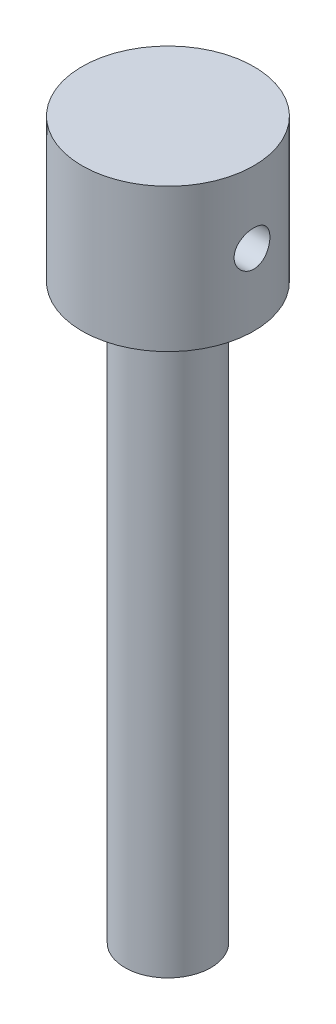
ISO-10303-21;
HEADER;
FILE_DESCRIPTION(('STEP AP214'),'2;1');
FILE_NAME('part.step','',(''),(''),'','','');
FILE_SCHEMA(('AUTOMOTIVE_DESIGN { 1 0 10303 214 1 1 1 1 }'));
ENDSEC;
DATA;
#1=APPLICATION_CONTEXT('core data for automotive mechanical design processes');
#2=APPLICATION_PROTOCOL_DEFINITION('international standard','automotive_design',2000,#1);
#3=PRODUCT_CONTEXT('',#1,'mechanical');
#4=PRODUCT('Part','Part','',(#3));
#5=PRODUCT_RELATED_PRODUCT_CATEGORY('part','',(#4));
#6=PRODUCT_DEFINITION_FORMATION('','',#4);
#7=PRODUCT_DEFINITION_CONTEXT('part definition',#1,'design');
#8=PRODUCT_DEFINITION('design','',#6,#7);
#9=PRODUCT_DEFINITION_SHAPE('','',#8);
#10=(LENGTH_UNIT() NAMED_UNIT(*) SI_UNIT(.MILLI.,.METRE.));
#11=(NAMED_UNIT(*) PLANE_ANGLE_UNIT() SI_UNIT($,.RADIAN.));
#12=(NAMED_UNIT(*) SI_UNIT($,.STERADIAN.) SOLID_ANGLE_UNIT());
#13=UNCERTAINTY_MEASURE_WITH_UNIT(LENGTH_MEASURE(1.E-05),#10,'distance_accuracy_value','');
#14=(GEOMETRIC_REPRESENTATION_CONTEXT(3) GLOBAL_UNCERTAINTY_ASSIGNED_CONTEXT((#13)) GLOBAL_UNIT_ASSIGNED_CONTEXT((#10,
#11,#12)) REPRESENTATION_CONTEXT('',''));
#15=CARTESIAN_POINT('',(0.,0.,0.));
#16=DIRECTION('',(0.,0.,1.));
#17=DIRECTION('',(1.,0.,0.));
#18=AXIS2_PLACEMENT_3D('',#15,#16,#17);
#19=CARTESIAN_POINT('',(0.,-20.,0.));
#20=DIRECTION('',(0.,1.,0.));
#21=DIRECTION('',(0.,0.,1.));
#22=AXIS2_PLACEMENT_3D('',#19,#20,#21);
#23=CYLINDRICAL_SURFACE('',#22,12.);
#24=CARTESIAN_POINT('',(-11.7366945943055,-10.,-2.5));
#25=CARTESIAN_POINT('',(-11.7366973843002,-10.1387812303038,-2.499995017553));
#26=CARTESIAN_POINT('',(-11.7391829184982,-10.2776239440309,-2.48840458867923));
#27=CARTESIAN_POINT('',(-11.7488403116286,-10.551372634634,-2.44239298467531));
#28=CARTESIAN_POINT('',(-11.7560157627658,-10.6862755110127,-2.40795430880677));
#29=CARTESIAN_POINT('',(-11.7742058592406,-10.9481447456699,-2.31736795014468));
#30=CARTESIAN_POINT('',(-11.7852165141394,-11.0751191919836,-2.26124282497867));
#31=CARTESIAN_POINT('',(-11.8098316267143,-11.3178489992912,-2.12893977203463));
#32=CARTESIAN_POINT('',(-11.8234359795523,-11.43360481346,-2.05276265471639));
#33=CARTESIAN_POINT('',(-11.8519386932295,-11.6523907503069,-1.88127279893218));
#34=CARTESIAN_POINT('',(-11.8668522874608,-11.7552237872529,-1.78571110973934));
#35=CARTESIAN_POINT('',(-11.8961593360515,-11.9435221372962,-1.57870244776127));
#36=CARTESIAN_POINT('',(-11.9105527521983,-12.0289861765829,-1.46725431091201));
#37=CARTESIAN_POINT('',(-11.937362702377,-12.1808917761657,-1.23032410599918));
#38=CARTESIAN_POINT('',(-11.9497591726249,-12.2471450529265,-1.10471885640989));
#39=CARTESIAN_POINT('',(-11.971006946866,-12.3575321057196,-0.843857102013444));
#40=CARTESIAN_POINT('',(-11.9798586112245,-12.4016681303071,-0.708601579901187));
#41=CARTESIAN_POINT('',(-11.9929117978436,-12.4659515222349,-0.434325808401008));
#42=CARTESIAN_POINT('',(-11.9971778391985,-12.4864320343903,-0.295386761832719));
#43=CARTESIAN_POINT('',(-12.0008022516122,-12.503863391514,-0.0159836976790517));
#44=CARTESIAN_POINT('',(-12.0001611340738,-12.5008166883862,0.124480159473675));
#45=CARTESIAN_POINT('',(-11.9940931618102,-12.4715307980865,0.400653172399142));
#46=CARTESIAN_POINT('',(-11.9887403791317,-12.4456505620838,0.536402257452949));
#47=CARTESIAN_POINT('',(-11.9739344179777,-12.3720027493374,0.801587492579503));
#48=CARTESIAN_POINT('',(-11.9644810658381,-12.3242342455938,0.931023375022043));
#49=CARTESIAN_POINT('',(-11.9424153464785,-12.207839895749,1.18092001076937));
#50=CARTESIAN_POINT('',(-11.9297820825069,-12.1390754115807,1.3013142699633));
#51=CARTESIAN_POINT('',(-11.9027460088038,-11.9827439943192,1.5289869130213));
#52=CARTESIAN_POINT('',(-11.8883429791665,-11.8951747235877,1.63626366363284));
#53=CARTESIAN_POINT('',(-11.8590340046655,-11.7017567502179,1.83678840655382));
#54=CARTESIAN_POINT('',(-11.8441236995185,-11.5955938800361,1.92973297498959));
#55=CARTESIAN_POINT('',(-11.8157374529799,-11.3690359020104,2.09655194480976));
#56=CARTESIAN_POINT('',(-11.8022615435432,-11.2486404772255,2.1704259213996));
#57=CARTESIAN_POINT('',(-11.7782599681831,-10.9965754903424,2.29712434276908));
#58=CARTESIAN_POINT('',(-11.7677417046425,-10.8648786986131,2.34989610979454));
#59=CARTESIAN_POINT('',(-11.7509521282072,-10.5942167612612,2.43247155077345));
#60=CARTESIAN_POINT('',(-11.7446802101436,-10.4552526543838,2.46227849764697));
#61=CARTESIAN_POINT('',(-11.7372156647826,-10.1767605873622,2.49761727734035));
#62=CARTESIAN_POINT('',(-11.7359310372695,-10.0372908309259,2.50358885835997));
#63=CARTESIAN_POINT('',(-11.7383390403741,-9.75934837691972,2.49227386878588));
#64=CARTESIAN_POINT('',(-11.7420313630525,-9.62087561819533,2.47498873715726));
#65=CARTESIAN_POINT('',(-11.7538907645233,-9.35035896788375,2.41803116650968));
#66=CARTESIAN_POINT('',(-11.76201022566,-9.21826266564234,2.37859682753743));
#67=CARTESIAN_POINT('',(-11.7817667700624,-8.96255202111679,2.27871621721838));
#68=CARTESIAN_POINT('',(-11.7934041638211,-8.8389384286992,2.21826809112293));
#69=CARTESIAN_POINT('',(-11.8190900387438,-8.60178711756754,2.07709196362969));
#70=CARTESIAN_POINT('',(-11.8331701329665,-8.48841559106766,1.99609065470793));
#71=CARTESIAN_POINT('',(-11.8620696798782,-8.27671350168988,1.81646888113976));
#72=CARTESIAN_POINT('',(-11.8768892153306,-8.17838462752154,1.71784644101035));
#73=CARTESIAN_POINT('',(-11.9058984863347,-7.99787457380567,1.50380090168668));
#74=CARTESIAN_POINT('',(-11.9200734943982,-7.91599180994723,1.38812381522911));
#75=CARTESIAN_POINT('',(-11.9459341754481,-7.77282249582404,1.14440020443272));
#76=CARTESIAN_POINT('',(-11.9576199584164,-7.7115350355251,1.01635422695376));
#77=CARTESIAN_POINT('',(-11.9771229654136,-7.61172264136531,0.752284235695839));
#78=CARTESIAN_POINT('',(-11.9849632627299,-7.57306166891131,0.616313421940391));
#79=CARTESIAN_POINT('',(-11.9959912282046,-7.51917119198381,0.339626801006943));
#80=CARTESIAN_POINT('',(-11.9991795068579,-7.50393861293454,0.198911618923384));
#81=CARTESIAN_POINT('',(-12.0005281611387,-7.49746475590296,-0.0804266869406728));
#82=CARTESIAN_POINT('',(-11.9987822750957,-7.5057762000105,-0.219039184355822));
#83=CARTESIAN_POINT('',(-11.99065748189,-7.5451612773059,-0.492845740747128));
#84=CARTESIAN_POINT('',(-11.9842786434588,-7.57623457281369,-0.628039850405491));
#85=CARTESIAN_POINT('',(-11.9676092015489,-7.66005558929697,-0.890863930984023));
#86=CARTESIAN_POINT('',(-11.9573290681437,-7.71274532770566,-1.01851310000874));
#87=CARTESIAN_POINT('',(-11.9339599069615,-7.83824479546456,-1.2632211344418));
#88=CARTESIAN_POINT('',(-11.9208706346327,-7.91105627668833,-1.38027907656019));
#89=CARTESIAN_POINT('',(-11.8930319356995,-8.07621933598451,-1.60268064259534));
#90=CARTESIAN_POINT('',(-11.8782576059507,-8.1688885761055,-1.70778526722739));
#91=CARTESIAN_POINT('',(-11.8488557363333,-8.37048900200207,-1.90110548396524));
#92=CARTESIAN_POINT('',(-11.8342282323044,-8.47942405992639,-1.98931704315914));
#93=CARTESIAN_POINT('',(-11.8065838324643,-8.71201820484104,-2.14734903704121));
#94=CARTESIAN_POINT('',(-11.7935881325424,-8.83583682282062,-2.21693856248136));
#95=CARTESIAN_POINT('',(-11.7709407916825,-9.09365031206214,-2.3342125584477));
#96=CARTESIAN_POINT('',(-11.7612862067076,-9.22763609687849,-2.381916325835));
#97=CARTESIAN_POINT('',(-11.7482800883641,-9.4682125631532,-2.44513108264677));
#98=CARTESIAN_POINT('',(-11.7439632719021,-9.57345907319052,-2.46566898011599));
#99=CARTESIAN_POINT('',(-11.7381695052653,-9.78579156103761,-2.49310508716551));
#100=CARTESIAN_POINT('',(-11.7366924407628,-9.89287746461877,-2.50000384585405));
#101=CARTESIAN_POINT('',(-11.7366945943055,-10.,-2.5));
#102=B_SPLINE_CURVE_WITH_KNOTS('',3,(#24,#25,#26,#27,#28,#29,#30,#31,#32,#33,#34,#35,#36,#37,
#38,#39,#40,#41,#42,#43,#44,#45,#46,#47,#48,#49,#50,#51,#52,#53,#54,#55,#56,#57,#58,#59,#60,#61,
#62,#63,#64,#65,#66,#67,#68,#69,#70,#71,#72,#73,#74,#75,#76,#77,#78,#79,#80,#81,#82,#83,#84,#85,
#86,#87,#88,#89,#90,#91,#92,#93,#94,#95,#96,#97,#98,#99,#100,#101),.UNSPECIFIED.,.T.,.F.,(4,2,2,
2,2,2,2,2,2,2,2,2,2,2,2,2,2,2,2,2,2,2,2,2,2,2,2,2,2,2,2,2,2,2,2,2,2,2,4),(0.,0.415951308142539,
0.832221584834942,1.24806002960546,1.66388166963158,2.0854266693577,2.50700257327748,
2.93258052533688,3.35811520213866,3.77758097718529,4.19700303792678,4.60994682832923,
5.02290810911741,5.43865743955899,5.8544584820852,6.27811724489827,6.70178544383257,
7.12650474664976,7.55116350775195,7.96795032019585,8.38471134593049,8.79707572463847,
9.20947650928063,9.62767835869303,10.0459271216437,10.4711891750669,10.8964324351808,
11.3190919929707,11.7416960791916,12.1563258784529,12.5709495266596,12.984468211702,
13.3980229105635,13.8187663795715,14.2396101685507,14.6654530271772,15.0909196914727,
15.4119973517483,15.7330620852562),.UNSPECIFIED.);
#103=CARTESIAN_POINT('',(-11.7366945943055,-10.,-2.5));
#104=VERTEX_POINT('',#103);
#105=EDGE_CURVE('E41',#104,#104,#102,.T.);
#106=ORIENTED_EDGE('',*,*,#105,.F.);
#107=EDGE_LOOP('',(#106));
#108=FACE_BOUND('',#107,.T.);
#109=CARTESIAN_POINT('',(11.7366945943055,-10.,-2.5));
#110=CARTESIAN_POINT('',(11.7366973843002,-9.86121876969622,-2.499995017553));
#111=CARTESIAN_POINT('',(11.7391829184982,-9.7223760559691,-2.48840458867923));
#112=CARTESIAN_POINT('',(11.7488403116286,-9.44862736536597,-2.44239298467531));
#113=CARTESIAN_POINT('',(11.7560157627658,-9.31372448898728,-2.40795430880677));
#114=CARTESIAN_POINT('',(11.7742058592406,-9.05185525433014,-2.31736795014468));
#115=CARTESIAN_POINT('',(11.7852165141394,-8.92488080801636,-2.26124282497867));
#116=CARTESIAN_POINT('',(11.8098316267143,-8.68215100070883,-2.12893977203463));
#117=CARTESIAN_POINT('',(11.8234359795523,-8.56639518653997,-2.05276265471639));
#118=CARTESIAN_POINT('',(11.8519386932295,-8.34760924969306,-1.88127279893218));
#119=CARTESIAN_POINT('',(11.8668522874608,-8.24477621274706,-1.78571110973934));
#120=CARTESIAN_POINT('',(11.8961593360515,-8.05647786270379,-1.57870244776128));
#121=CARTESIAN_POINT('',(11.9105527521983,-7.97101382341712,-1.46725431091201));
#122=CARTESIAN_POINT('',(11.937362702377,-7.81910822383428,-1.23032410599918));
#123=CARTESIAN_POINT('',(11.9497591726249,-7.75285494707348,-1.10471885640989));
#124=CARTESIAN_POINT('',(11.971006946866,-7.64246789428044,-0.843857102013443));
#125=CARTESIAN_POINT('',(11.9798586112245,-7.59833186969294,-0.708601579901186));
#126=CARTESIAN_POINT('',(11.9929117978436,-7.53404847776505,-0.434325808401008));
#127=CARTESIAN_POINT('',(11.9971778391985,-7.51356796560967,-0.295386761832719));
#128=CARTESIAN_POINT('',(12.0008022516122,-7.49613660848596,-0.0159836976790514));
#129=CARTESIAN_POINT('',(12.0001611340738,-7.49918331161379,0.124480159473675));
#130=CARTESIAN_POINT('',(11.9940931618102,-7.52846920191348,0.400653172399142));
#131=CARTESIAN_POINT('',(11.9887403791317,-7.55434943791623,0.536402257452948));
#132=CARTESIAN_POINT('',(11.9739344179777,-7.62799725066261,0.801587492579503));
#133=CARTESIAN_POINT('',(11.9644810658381,-7.67576575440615,0.931023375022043));
#134=CARTESIAN_POINT('',(11.9424153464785,-7.79216010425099,1.18092001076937));
#135=CARTESIAN_POINT('',(11.9297820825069,-7.86092458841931,1.3013142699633));
#136=CARTESIAN_POINT('',(11.9027460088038,-8.01725600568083,1.5289869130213));
#137=CARTESIAN_POINT('',(11.8883429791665,-8.10482527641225,1.63626366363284));
#138=CARTESIAN_POINT('',(11.8590340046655,-8.29824324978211,1.83678840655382));
#139=CARTESIAN_POINT('',(11.8441236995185,-8.40440611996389,1.92973297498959));
#140=CARTESIAN_POINT('',(11.8157374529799,-8.6309640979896,2.09655194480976));
#141=CARTESIAN_POINT('',(11.8022615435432,-8.75135952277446,2.1704259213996));
#142=CARTESIAN_POINT('',(11.7782599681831,-9.00342450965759,2.29712434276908));
#143=CARTESIAN_POINT('',(11.7677417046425,-9.13512130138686,2.34989610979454));
#144=CARTESIAN_POINT('',(11.7509521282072,-9.40578323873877,2.43247155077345));
#145=CARTESIAN_POINT('',(11.7446802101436,-9.54474734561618,2.46227849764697));
#146=CARTESIAN_POINT('',(11.7372156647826,-9.82323941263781,2.49761727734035));
#147=CARTESIAN_POINT('',(11.7359310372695,-9.96270916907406,2.50358885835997));
#148=CARTESIAN_POINT('',(11.7383390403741,-10.2406516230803,2.49227386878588));
#149=CARTESIAN_POINT('',(11.7420313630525,-10.3791243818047,2.47498873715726));
#150=CARTESIAN_POINT('',(11.7538907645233,-10.6496410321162,2.41803116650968));
#151=CARTESIAN_POINT('',(11.7620102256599,-10.7817373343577,2.37859682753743));
#152=CARTESIAN_POINT('',(11.7817667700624,-11.0374479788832,2.27871621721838));
#153=CARTESIAN_POINT('',(11.7934041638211,-11.1610615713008,2.21826809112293));
#154=CARTESIAN_POINT('',(11.8190900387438,-11.3982128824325,2.07709196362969));
#155=CARTESIAN_POINT('',(11.8331701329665,-11.5115844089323,1.99609065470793));
#156=CARTESIAN_POINT('',(11.8620696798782,-11.7232864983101,1.81646888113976));
#157=CARTESIAN_POINT('',(11.8768892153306,-11.8216153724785,1.71784644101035));
#158=CARTESIAN_POINT('',(11.9058984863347,-12.0021254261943,1.50380090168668));
#159=CARTESIAN_POINT('',(11.9200734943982,-12.0840081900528,1.38812381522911));
#160=CARTESIAN_POINT('',(11.9459341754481,-12.227177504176,1.14440020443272));
#161=CARTESIAN_POINT('',(11.9576199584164,-12.2884649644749,1.01635422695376));
#162=CARTESIAN_POINT('',(11.9771229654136,-12.3882773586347,0.752284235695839));
#163=CARTESIAN_POINT('',(11.9849632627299,-12.4269383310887,0.616313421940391));
#164=CARTESIAN_POINT('',(11.9959912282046,-12.4808288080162,0.339626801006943));
#165=CARTESIAN_POINT('',(11.9991795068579,-12.4960613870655,0.198911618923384));
#166=CARTESIAN_POINT('',(12.0005281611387,-12.502535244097,-0.0804266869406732));
#167=CARTESIAN_POINT('',(11.9987822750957,-12.4942237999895,-0.219039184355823));
#168=CARTESIAN_POINT('',(11.99065748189,-12.4548387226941,-0.492845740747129));
#169=CARTESIAN_POINT('',(11.9842786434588,-12.4237654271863,-0.628039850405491));
#170=CARTESIAN_POINT('',(11.9676092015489,-12.339944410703,-0.890863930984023));
#171=CARTESIAN_POINT('',(11.9573290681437,-12.2872546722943,-1.01851310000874));
#172=CARTESIAN_POINT('',(11.9339599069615,-12.1617552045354,-1.2632211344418));
#173=CARTESIAN_POINT('',(11.9208706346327,-12.0889437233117,-1.38027907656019));
#174=CARTESIAN_POINT('',(11.8930319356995,-11.9237806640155,-1.60268064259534));
#175=CARTESIAN_POINT('',(11.8782576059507,-11.8311114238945,-1.70778526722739));
#176=CARTESIAN_POINT('',(11.8488557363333,-11.6295109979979,-1.90110548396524));
#177=CARTESIAN_POINT('',(11.8342282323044,-11.5205759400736,-1.98931704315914));
#178=CARTESIAN_POINT('',(11.8065838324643,-11.287981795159,-2.14734903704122));
#179=CARTESIAN_POINT('',(11.7935881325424,-11.1641631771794,-2.21693856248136));
#180=CARTESIAN_POINT('',(11.7709407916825,-10.9063496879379,-2.3342125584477));
#181=CARTESIAN_POINT('',(11.7612862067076,-10.7723639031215,-2.381916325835));
#182=CARTESIAN_POINT('',(11.7482800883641,-10.5317874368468,-2.44513108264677));
#183=CARTESIAN_POINT('',(11.7439632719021,-10.4265409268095,-2.46566898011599));
#184=CARTESIAN_POINT('',(11.7381695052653,-10.2142084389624,-2.49310508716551));
#185=CARTESIAN_POINT('',(11.7366924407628,-10.1071225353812,-2.50000384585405));
#186=CARTESIAN_POINT('',(11.7366945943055,-10.,-2.5));
#187=B_SPLINE_CURVE_WITH_KNOTS('',3,(#109,#110,#111,#112,#113,#114,#115,#116,#117,#118,#119,
#120,#121,#122,#123,#124,#125,#126,#127,#128,#129,#130,#131,#132,#133,#134,#135,#136,#137,#138,
#139,#140,#141,#142,#143,#144,#145,#146,#147,#148,#149,#150,#151,#152,#153,#154,#155,#156,#157,
#158,#159,#160,#161,#162,#163,#164,#165,#166,#167,#168,#169,#170,#171,#172,#173,#174,#175,#176,
#177,#178,#179,#180,#181,#182,#183,#184,#185,#186),.UNSPECIFIED.,.T.,.F.,(4,2,2,2,2,2,2,2,2,2,2,
2,2,2,2,2,2,2,2,2,2,2,2,2,2,2,2,2,2,2,2,2,2,2,2,2,2,2,4),(0.,0.415951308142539,
0.832221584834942,1.24806002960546,1.66388166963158,2.0854266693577,2.50700257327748,
2.93258052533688,3.35811520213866,3.77758097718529,4.19700303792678,4.60994682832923,
5.02290810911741,5.43865743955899,5.8544584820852,6.27811724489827,6.70178544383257,
7.12650474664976,7.55116350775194,7.96795032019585,8.38471134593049,8.79707572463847,
9.20947650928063,9.62767835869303,10.0459271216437,10.4711891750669,10.8964324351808,
11.3190919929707,11.7416960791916,12.1563258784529,12.5709495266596,12.984468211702,
13.3980229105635,13.8187663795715,14.2396101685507,14.6654530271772,15.0909196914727,
15.4119973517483,15.7330620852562),.UNSPECIFIED.);
#188=CARTESIAN_POINT('',(11.7366945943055,-10.,-2.5));
#189=VERTEX_POINT('',#188);
#190=EDGE_CURVE('E10',#189,#189,#187,.T.);
#191=ORIENTED_EDGE('',*,*,#190,.F.);
#192=EDGE_LOOP('',(#191));
#193=FACE_BOUND('',#192,.T.);
#194=CARTESIAN_POINT('',(0.,-20.,0.));
#195=DIRECTION('',(0.,1.,0.));
#196=DIRECTION('',(0.,0.,1.));
#197=AXIS2_PLACEMENT_3D('',#194,#195,#196);
#198=CIRCLE('',#197,12.);
#199=CARTESIAN_POINT('',(0.,-20.,12.));
#200=VERTEX_POINT('',#199);
#201=EDGE_CURVE('E55',#200,#200,#198,.T.);
#202=ORIENTED_EDGE('',*,*,#201,.T.);
#203=EDGE_LOOP('',(#202));
#204=FACE_BOUND('',#203,.T.);
#205=CARTESIAN_POINT('',(0.,0.,0.));
#206=DIRECTION('',(0.,1.,0.));
#207=DIRECTION('',(0.,0.,1.));
#208=AXIS2_PLACEMENT_3D('',#205,#206,#207);
#209=CIRCLE('',#208,12.);
#210=CARTESIAN_POINT('',(0.,0.,12.));
#211=VERTEX_POINT('',#210);
#212=EDGE_CURVE('E61',#211,#211,#209,.T.);
#213=ORIENTED_EDGE('',*,*,#212,.F.);
#214=EDGE_LOOP('',(#213));
#215=FACE_BOUND('',#214,.T.);
#216=ADVANCED_FACE('F37',(#108,#193,#204,#215),#23,.T.);
#217=CARTESIAN_POINT('',(0.,-20.,0.));
#218=DIRECTION('',(0.,1.,0.));
#219=DIRECTION('',(0.,0.,1.));
#220=AXIS2_PLACEMENT_3D('',#217,#218,#219);
#221=PLANE('',#220);
#222=CARTESIAN_POINT('',(0.,-20.,0.));
#223=DIRECTION('',(0.,-1.,0.));
#224=DIRECTION('',(0.,0.,-1.));
#225=AXIS2_PLACEMENT_3D('',#222,#223,#224);
#226=CIRCLE('',#225,6.);
#227=CARTESIAN_POINT('',(0.,-20.,-6.));
#228=VERTEX_POINT('',#227);
#229=EDGE_CURVE('E50',#228,#228,#226,.T.);
#230=ORIENTED_EDGE('',*,*,#229,.F.);
#231=EDGE_LOOP('',(#230));
#232=FACE_BOUND('',#231,.T.);
#233=ORIENTED_EDGE('',*,*,#201,.F.);
#234=EDGE_LOOP('',(#233));
#235=FACE_BOUND('',#234,.T.);
#236=ADVANCED_FACE('F78',(#232,#235),#221,.F.);
#237=CARTESIAN_POINT('',(0.,0.,0.));
#238=DIRECTION('',(0.,1.,0.));
#239=DIRECTION('',(0.,0.,1.));
#240=AXIS2_PLACEMENT_3D('',#237,#238,#239);
#241=PLANE('',#240);
#242=ORIENTED_EDGE('',*,*,#212,.T.);
#243=EDGE_LOOP('',(#242));
#244=FACE_BOUND('',#243,.T.);
#245=ADVANCED_FACE('F76',(#244),#241,.T.);
#246=CARTESIAN_POINT('',(0.,-100.,0.));
#247=DIRECTION('',(0.,1.,0.));
#248=DIRECTION('',(0.,0.,1.));
#249=AXIS2_PLACEMENT_3D('',#246,#247,#248);
#250=CYLINDRICAL_SURFACE('',#249,6.);
#251=CARTESIAN_POINT('',(0.,-100.,0.));
#252=DIRECTION('',(0.,-1.,0.));
#253=DIRECTION('',(0.,0.,-1.));
#254=AXIS2_PLACEMENT_3D('',#251,#252,#253);
#255=CIRCLE('',#254,6.);
#256=CARTESIAN_POINT('',(0.,-100.,-6.));
#257=VERTEX_POINT('',#256);
#258=EDGE_CURVE('E99',#257,#257,#255,.T.);
#259=ORIENTED_EDGE('',*,*,#258,.F.);
#260=EDGE_LOOP('',(#259));
#261=FACE_BOUND('',#260,.T.);
#262=ORIENTED_EDGE('',*,*,#229,.T.);
#263=EDGE_LOOP('',(#262));
#264=FACE_BOUND('',#263,.T.);
#265=ADVANCED_FACE('F72',(#261,#264),#250,.T.);
#266=CARTESIAN_POINT('',(0.,-100.,0.));
#267=DIRECTION('',(0.,-1.,0.));
#268=DIRECTION('',(0.,0.,-1.));
#269=AXIS2_PLACEMENT_3D('',#266,#267,#268);
#270=PLANE('',#269);
#271=ORIENTED_EDGE('',*,*,#258,.T.);
#272=EDGE_LOOP('',(#271));
#273=FACE_BOUND('',#272,.T.);
#274=ADVANCED_FACE('F67',(#273),#270,.T.);
#275=CARTESIAN_POINT('',(-68.,-10.,0.));
#276=DIRECTION('',(1.,0.,0.));
#277=DIRECTION('',(0.,0.,-1.));
#278=AXIS2_PLACEMENT_3D('',#275,#276,#277);
#279=CYLINDRICAL_SURFACE('',#278,2.5);
#280=ORIENTED_EDGE('',*,*,#105,.T.);
#281=EDGE_LOOP('',(#280));
#282=FACE_BOUND('',#281,.T.);
#283=ORIENTED_EDGE('',*,*,#190,.T.);
#284=EDGE_LOOP('',(#283));
#285=FACE_BOUND('',#284,.T.);
#286=ADVANCED_FACE('F63',(#282,#285),#279,.F.);
#287=CLOSED_SHELL('',(#216,#236,#245,#265,#274,#286));
#288=MANIFOLD_SOLID_BREP('B2',#287);
#289=ADVANCED_BREP_SHAPE_REPRESENTATION('',(#18,#288),#14);
#290=SHAPE_DEFINITION_REPRESENTATION(#9,#289);
ENDSEC;
END-ISO-10303-21;
